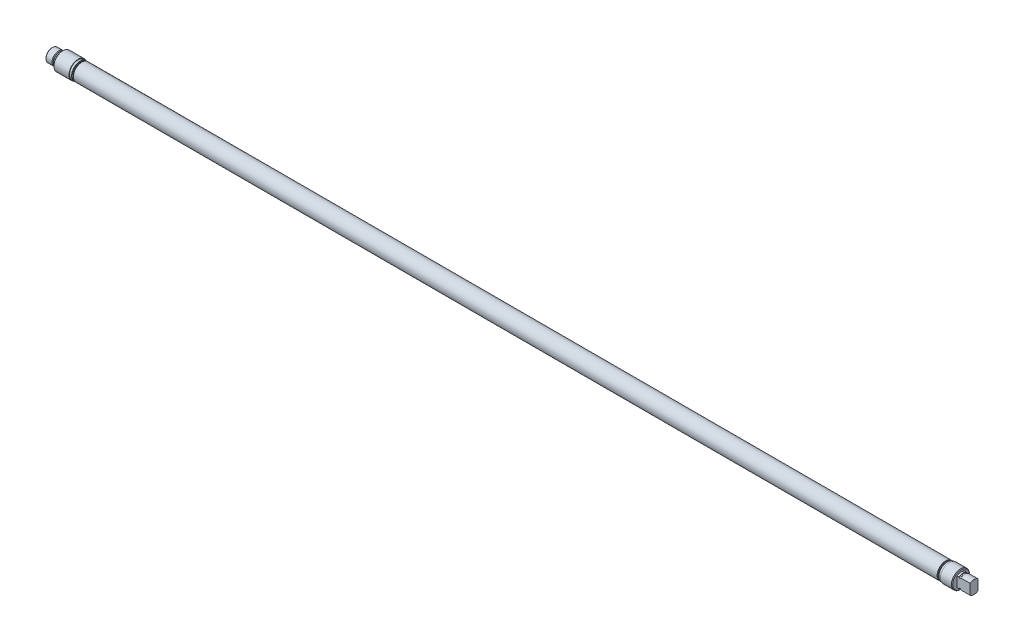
from build123d import *

# Parameters (mm, degrees)
CUT_EXTRUDE1_DEPTH      = 1122.643357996
CUT_EXTRUDE1_DEPTH_BACK = 1122.643357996
SKETCH14_W              = 15.748
SKETCH14_H              = 3.0861
CHAMFER1_SIZE           = 0.762


with BuildPart() as part:
    # Sketch2 → Base-Revolve (revolve)
    with BuildSketch(Plane.XY, mode=Mode.PRIVATE) as base_revolve_sk:
        with BuildLine():
            Line((1091.565, 10.287), (31.75, 10.287))
            Line((31.75, 10.287), (31.75, 10.922))
            Line((31.75, 10.922), (12.7, 10.922))
            Line((12.7, 10.922), (12.7, 7.9121))
            Line((12.7, 7.9121), (10.414, 7.9121))
            Line((10.414, 7.9121), (10.414, 7.62))
            ThreePointArc((10.414, 7.62), (10.265210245, 7.260789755), (9.906, 7.112))
            Line((9.906, 7.112), (9.10042049, 7.112))
            ThreePointArc((9.10042049, 7.112), (8.906017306, 7.150669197), (8.741210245, 7.260789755))
            Line((8.741210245, 7.260789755), (8.0899, 7.9121))
            Line((8.0899, 7.9121), (0, 7.9121))
            Line((0, 7.9121), (0, 0))
            Line((0, 0), (1121.537, 0))
            Line((1121.537, 0), (1121.537, 7.9121))
            Line((1121.537, 7.9121), (1110.3991, 7.9121))
            Line((1110.3991, 7.9121), (1109.599, 7.112))
            Line((1109.599, 7.112), (1108.075, 7.112))
            Line((1108.075, 7.112), (1108.075, 7.9121))
            Line((1108.075, 7.9121), (1105.789, 7.9121))
            Line((1105.789, 7.9121), (1105.789, 10.922))
            Line((1105.789, 10.922), (1091.565, 10.922))
            Line((1091.565, 10.922), (1091.565, 10.287))
        make_face()
    revolve(base_revolve_sk.sketch.rotate(Axis((-21.417447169, 0, 0), (1, 0, 0)), 90), axis=Axis((-21.417447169, 0, 0), (1, 0, 0)))

    # Sketch3 → Cut-Revolve1 (revolve, cut)
    with BuildSketch(Plane.XY, mode=Mode.PRIVATE) as cut_revolve1_sk:
        Polygon((34.29, 10.287), (34.29, 9.398), (35.179, 10.287), align=None)
        Polygon((35.56, 10.287), (35.56, 9.398), (36.449, 10.287), align=None)
    revolve(cut_revolve1_sk.sketch.rotate(Axis((0, 0, 0), (1, 0, 0)), 90), axis=Axis((0, 0, 0), (1, 0, 0)), mode=Mode.SUBTRACT)

    # Sketch6 → Cut-Revolve2 (revolve, cut)
    with BuildSketch(Plane.XY, mode=Mode.PRIVATE) as cut_revolve2_sk:
        Polygon((1073.5945, 0), (1073.5945, 9.525), (44.8945, 9.525), (44.8945, 3.175), (0, 3.175), (0, 0), align=None)
    revolve(cut_revolve2_sk.sketch.rotate(Axis((0, 0, 0), (-1, 0, 0)), 90), axis=Axis((0, 0, 0), (-1, 0, 0)), mode=Mode.SUBTRACT)

    # Sketch13 → Cut-Revolve5 (revolve, cut)
    with BuildSketch(Plane.XY, mode=Mode.PRIVATE) as cut_revolve5_sk:
        Polygon((1086.993, 10.287), (1087.755, 10.287), (1087.755, 9.525), align=None)
        Polygon((1088.263, 10.287), (1089.025, 10.287), (1089.025, 9.525), align=None)
    revolve(cut_revolve5_sk.sketch.rotate(Axis((-4.583082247, 0, 0), (1, 0, 0)), 90), axis=Axis((-4.583082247, 0, 0), (1, 0, 0)), mode=Mode.SUBTRACT)

    # Sketch14 → Cut-Extrude1 (cut, two sides: drawn at the far end of the back side and taken through both)
    with BuildSketch(Plane(origin=(0, 0, 0), x_dir=(1, 0, 0), z_dir=(0, 1, 0)).offset(-CUT_EXTRUDE1_DEPTH_BACK)):
        with Locations((1113.663, 6.36905)):
            Rectangle(SKETCH14_W, SKETCH14_H)
        with Locations((1113.663, -6.36905)):
            Rectangle(SKETCH14_W, SKETCH14_H)
    extrude(amount=CUT_EXTRUDE1_DEPTH + CUT_EXTRUDE1_DEPTH_BACK, mode=Mode.SUBTRACT)

    # Chamfer1
    chamfer1_edges = [part.edges().sort_by_distance(p)[0] for p in [
        (0, 0, -7.9121),
        (1105.789, 0, -10.922),
        (12.7, 0, -10.922),
    ]]
    chamfer(chamfer1_edges, length=CHAMFER1_SIZE)


solid = part.part
